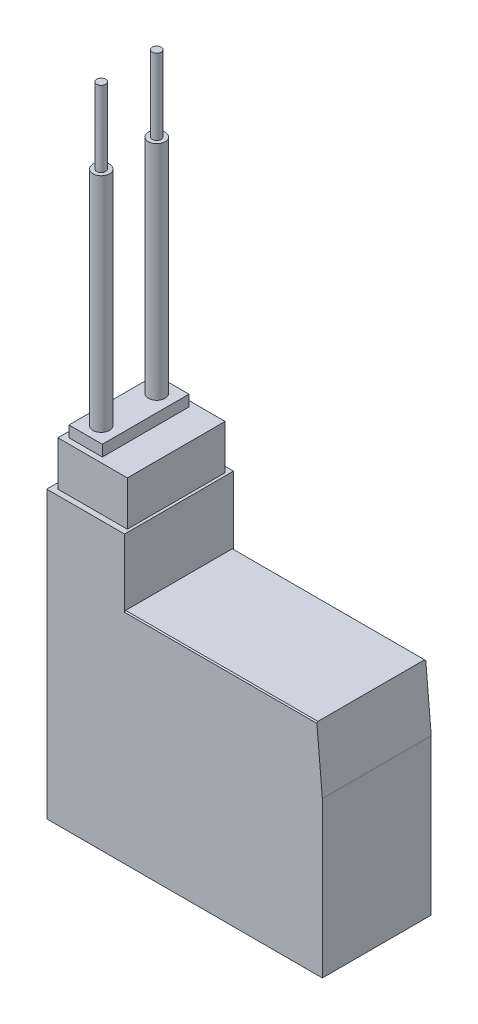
from build123d import *

# Parameters (mm, degrees)
BASE_EXTRUDE_DEPTH = 4.9
SKETCH2_W          = 7
SKETCH2_H          = 6
L_TYPE1_DEPTH      = 9.8
SKETCH3_W          = 6.25
SKETCH3_H          = 8.8
L_TYPE2_DEPTH      = 4
SKETCH4_W          = 3
SKETCH4_H          = 7.8
L_TYPE3_DEPTH      = 1
SKETCH5_R          = 0.75
L_TYPE4_DEPTH      = 20
SKETCH6_R          = 0.4
L_TYPE5_DEPTH      = 6.8
CHAMFER1_SIZE      = 0.1


with BuildPart() as part:
    # Sketch1 → Base-Extrude (new, symmetric)
    with BuildSketch(Plane.XY):
        Polygon((24.3, 19.7), (24.8, 13.984973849), (24.8, 0), (0, 0), (0, 19.7), align=None)
    extrude(amount=BASE_EXTRUDE_DEPTH, both=True)

    # Sketch2 → L type1 (add)
    with BuildSketch(Plane.XY.offset(4.9)):
        with Locations((3.5, 22.7)):
            Rectangle(SKETCH2_W, SKETCH2_H)
    extrude(amount=-L_TYPE1_DEPTH)

    # Sketch3 → L type2 (add)
    with BuildSketch(Plane(origin=(0, 25.7, 0), x_dir=(-1, 0, 0), z_dir=(0, 1, 0))):
        with Locations((-3.625, 0)):
            Rectangle(SKETCH3_W, SKETCH3_H)
    extrude(amount=L_TYPE2_DEPTH)

    # Sketch4 → L type3 (add)
    with BuildSketch(Plane(origin=(0, 29.7, 0), x_dir=(-1, 0, 0), z_dir=(0, 1, 0))):
        with Locations((-2.5, 0)):
            Rectangle(SKETCH4_W, SKETCH4_H)
    extrude(amount=L_TYPE3_DEPTH)

    # Sketch5 → L type4 (add)
    with BuildSketch(Plane(origin=(0, 30.7, 0), x_dir=(-1, 0, 0), z_dir=(0, 1, 0))):
        with Locations(Location((-2.5, -2.5, 0), (0, 0, 90))):
            Circle(SKETCH5_R)
        with Locations(Location((-2.5, 2.5, 0), (0, 0, 270))):
            Circle(SKETCH5_R)
    extrude(amount=L_TYPE4_DEPTH)

    # Sketch6 → L type5 (add)
    with BuildSketch(Plane(origin=(0, 50.7, 0), x_dir=(-1, 0, 0), z_dir=(0, 1, 0))):
        with Locations(Location((-2.5, 2.5, 0), (0, 0, 270))):
            Circle(SKETCH6_R)
        with Locations(Location((-2.5, -2.5, 0), (0, 0, 90))):
            Circle(SKETCH6_R)
    extrude(amount=L_TYPE5_DEPTH)

    # Chamfer1
    chamfer1_edges = [part.edges().sort_by_distance(p)[0] for p in [
        (15.65, 19.7, 4.9),
        (15.65, 19.7, -4.9),
    ]]
    chamfer(chamfer1_edges, length=CHAMFER1_SIZE)


solid = part.part
